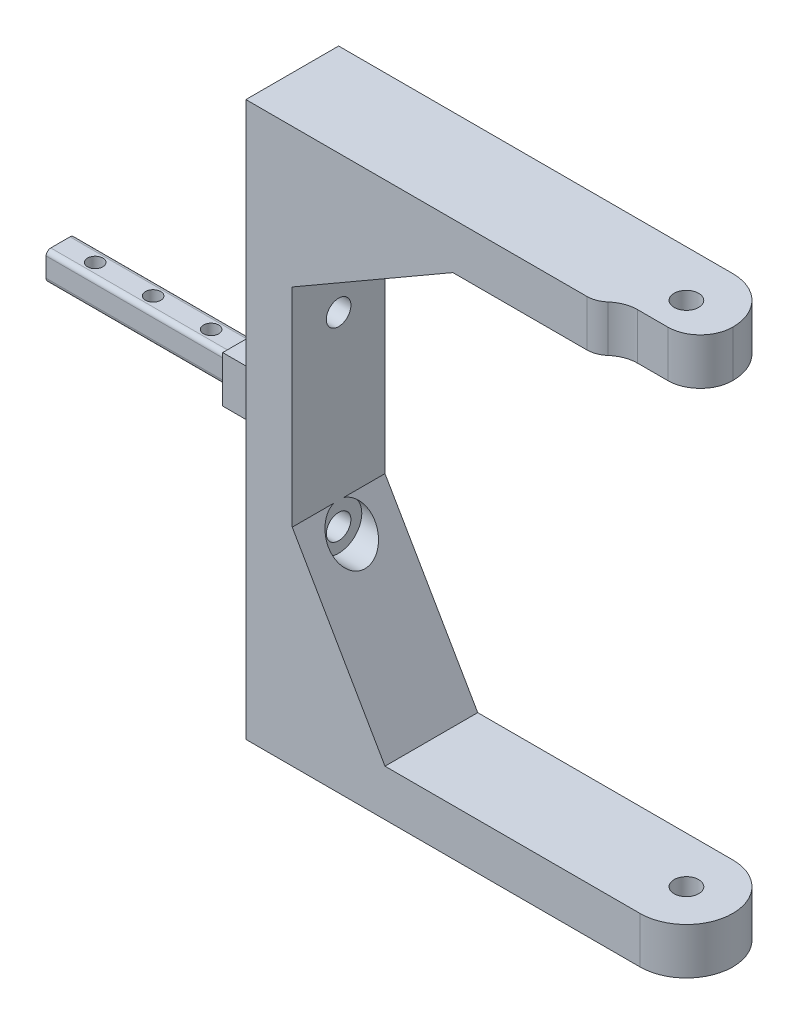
ISO-10303-21;
HEADER;
FILE_DESCRIPTION(('STEP AP214'),'2;1');
FILE_NAME('part.step','',(''),(''),'','','');
FILE_SCHEMA(('AUTOMOTIVE_DESIGN { 1 0 10303 214 1 1 1 1 }'));
ENDSEC;
DATA;
#1=APPLICATION_CONTEXT('core data for automotive mechanical design processes');
#2=APPLICATION_PROTOCOL_DEFINITION('international standard','automotive_design',2000,#1);
#3=PRODUCT_CONTEXT('',#1,'mechanical');
#4=PRODUCT('Part','Part','',(#3));
#5=PRODUCT_RELATED_PRODUCT_CATEGORY('part','',(#4));
#6=PRODUCT_DEFINITION_FORMATION('','',#4);
#7=PRODUCT_DEFINITION_CONTEXT('part definition',#1,'design');
#8=PRODUCT_DEFINITION('design','',#6,#7);
#9=PRODUCT_DEFINITION_SHAPE('','',#8);
#10=(LENGTH_UNIT() NAMED_UNIT(*) SI_UNIT(.MILLI.,.METRE.));
#11=(NAMED_UNIT(*) PLANE_ANGLE_UNIT() SI_UNIT($,.RADIAN.));
#12=(NAMED_UNIT(*) SI_UNIT($,.STERADIAN.) SOLID_ANGLE_UNIT());
#13=UNCERTAINTY_MEASURE_WITH_UNIT(LENGTH_MEASURE(1.E-05),#10,'distance_accuracy_value','');
#14=(GEOMETRIC_REPRESENTATION_CONTEXT(3) GLOBAL_UNCERTAINTY_ASSIGNED_CONTEXT((#13)) GLOBAL_UNIT_ASSIGNED_CONTEXT((#10,
#11,#12)) REPRESENTATION_CONTEXT('',''));
#15=CARTESIAN_POINT('',(0.,0.,0.));
#16=DIRECTION('',(0.,0.,1.));
#17=DIRECTION('',(1.,0.,0.));
#18=AXIS2_PLACEMENT_3D('',#15,#16,#17);
#19=CARTESIAN_POINT('',(85.,59.75,20.));
#20=DIRECTION('',(0.,-1.,0.));
#21=DIRECTION('',(1.,0.,0.));
#22=AXIS2_PLACEMENT_3D('',#19,#20,#21);
#23=PLANE('',#22);
#24=CARTESIAN_POINT('',(74.9999999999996,59.75,10.));
#25=DIRECTION('',(0.,1.,0.));
#26=DIRECTION('',(-1.,0.,0.));
#27=AXIS2_PLACEMENT_3D('',#24,#25,#26);
#28=CIRCLE('',#27,2.65);
#29=CARTESIAN_POINT('',(72.3499999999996,59.75,10.));
#30=VERTEX_POINT('',#29);
#31=EDGE_CURVE('E439',#30,#30,#28,.T.);
#32=ORIENTED_EDGE('',*,*,#31,.F.);
#33=EDGE_LOOP('',(#32));
#34=FACE_BOUND('',#33,.T.);
#35=DIRECTION('',(-1.,0.,0.));
#36=VECTOR('',#35,1.);
#37=CARTESIAN_POINT('',(0.,59.75,17.));
#38=LINE('',#37,#36);
#39=CARTESIAN_POINT('',(77.9999999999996,59.75,17.));
#40=VERTEX_POINT('',#39);
#41=CARTESIAN_POINT('',(71.4726462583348,59.75,17.));
#42=VERTEX_POINT('',#41);
#43=EDGE_CURVE('E937',#40,#42,#38,.T.);
#44=ORIENTED_EDGE('',*,*,#43,.F.);
#45=CARTESIAN_POINT('',(77.9999999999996,59.75,9.99999999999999));
#46=DIRECTION('',(0.,-1.,0.));
#47=DIRECTION('',(1.,0.,0.));
#48=AXIS2_PLACEMENT_3D('',#45,#46,#47);
#49=CIRCLE('',#48,7.);
#50=CARTESIAN_POINT('',(84.9999999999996,59.75,9.99999999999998));
#51=VERTEX_POINT('',#50);
#52=EDGE_CURVE('E310',#40,#51,#49,.F.);
#53=ORIENTED_EDGE('',*,*,#52,.T.);
#54=CARTESIAN_POINT('',(74.9999999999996,59.75,10.));
#55=DIRECTION('',(0.,1.,0.));
#56=DIRECTION('',(-1.,0.,0.));
#57=AXIS2_PLACEMENT_3D('',#54,#55,#56);
#58=CIRCLE('',#57,9.99999999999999);
#59=CARTESIAN_POINT('',(74.9999999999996,59.75,0.));
#60=VERTEX_POINT('',#59);
#61=EDGE_CURVE('E431',#51,#60,#58,.T.);
#62=ORIENTED_EDGE('',*,*,#61,.T.);
#63=DIRECTION('',(-1.,0.,0.));
#64=VECTOR('',#63,1.);
#65=CARTESIAN_POINT('',(85.,59.75,0.));
#66=LINE('',#65,#64);
#67=CARTESIAN_POINT('',(-9.99999999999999,59.75,0.));
#68=VERTEX_POINT('',#67);
#69=EDGE_CURVE('E352',#60,#68,#66,.T.);
#70=ORIENTED_EDGE('',*,*,#69,.T.);
#71=DIRECTION('',(0.,0.,-1.));
#72=VECTOR('',#71,1.);
#73=CARTESIAN_POINT('',(-9.99999999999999,59.75,20.));
#74=LINE('',#73,#72);
#75=CARTESIAN_POINT('',(-9.99999999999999,59.75,20.));
#76=VERTEX_POINT('',#75);
#77=EDGE_CURVE('E330',#76,#68,#74,.T.);
#78=ORIENTED_EDGE('',*,*,#77,.F.);
#79=DIRECTION('',(-1.,0.,0.));
#80=VECTOR('',#79,1.);
#81=CARTESIAN_POINT('',(85.,59.75,20.));
#82=LINE('',#81,#80);
#83=CARTESIAN_POINT('',(63.5353923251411,59.75,20.));
#84=VERTEX_POINT('',#83);
#85=EDGE_CURVE('E321',#84,#76,#82,.T.);
#86=ORIENTED_EDGE('',*,*,#85,.F.);
#87=CARTESIAN_POINT('',(63.5353923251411,59.75,15.));
#88=DIRECTION('',(0.,-1.,0.));
#89=DIRECTION('',(1.,0.,0.));
#90=AXIS2_PLACEMENT_3D('',#87,#88,#89);
#91=CIRCLE('',#90,5.);
#92=CARTESIAN_POINT('',(66.8425814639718,59.75,18.75));
#93=VERTEX_POINT('',#92);
#94=EDGE_CURVE('E308',#84,#93,#91,.F.);
#95=ORIENTED_EDGE('',*,*,#94,.T.);
#96=CARTESIAN_POINT('',(71.4726462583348,59.75,24.));
#97=DIRECTION('',(0.,1.,0.));
#98=DIRECTION('',(-1.,0.,0.));
#99=AXIS2_PLACEMENT_3D('',#96,#97,#98);
#100=CIRCLE('',#99,7.);
#101=EDGE_CURVE('E933',#42,#93,#100,.T.);
#102=ORIENTED_EDGE('',*,*,#101,.F.);
#103=EDGE_LOOP('',(#44,#53,#62,#70,#78,#86,#95,#102));
#104=FACE_BOUND('',#103,.T.);
#105=ADVANCED_FACE('F89',(#34,#104),#23,.F.);
#106=CARTESIAN_POINT('',(-9.99999999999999,-59.75,20.));
#107=DIRECTION('',(0.,1.,0.));
#108=DIRECTION('',(0.,0.,1.));
#109=AXIS2_PLACEMENT_3D('',#106,#107,#108);
#110=PLANE('',#109);
#111=CARTESIAN_POINT('',(74.9999999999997,-59.75,10.));
#112=DIRECTION('',(0.,1.,0.));
#113=DIRECTION('',(-1.,0.,0.));
#114=AXIS2_PLACEMENT_3D('',#111,#112,#113);
#115=CIRCLE('',#114,2.65);
#116=CARTESIAN_POINT('',(72.3499999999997,-59.75,10.));
#117=VERTEX_POINT('',#116);
#118=EDGE_CURVE('E435',#117,#117,#115,.T.);
#119=ORIENTED_EDGE('',*,*,#118,.T.);
#120=EDGE_LOOP('',(#119));
#121=FACE_BOUND('',#120,.T.);
#122=DIRECTION('',(1.,0.,0.));
#123=VECTOR('',#122,1.);
#124=CARTESIAN_POINT('',(-9.99999999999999,-59.75,0.));
#125=LINE('',#124,#123);
#126=CARTESIAN_POINT('',(-9.99999999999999,-59.75,0.));
#127=VERTEX_POINT('',#126);
#128=CARTESIAN_POINT('',(74.9999999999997,-59.75,0.));
#129=VERTEX_POINT('',#128);
#130=EDGE_CURVE('E356',#127,#129,#125,.T.);
#131=ORIENTED_EDGE('',*,*,#130,.T.);
#132=CARTESIAN_POINT('',(74.9999999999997,-59.75,10.));
#133=DIRECTION('',(0.,1.,0.));
#134=DIRECTION('',(-1.,0.,0.));
#135=AXIS2_PLACEMENT_3D('',#132,#133,#134);
#136=CIRCLE('',#135,9.99999999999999);
#137=CARTESIAN_POINT('',(74.9999999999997,-59.75,20.));
#138=VERTEX_POINT('',#137);
#139=EDGE_CURVE('E903',#138,#129,#136,.T.);
#140=ORIENTED_EDGE('',*,*,#139,.F.);
#141=DIRECTION('',(1.,0.,0.));
#142=VECTOR('',#141,1.);
#143=CARTESIAN_POINT('',(-9.99999999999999,-59.75,20.));
#144=LINE('',#143,#142);
#145=CARTESIAN_POINT('',(-9.99999999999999,-59.75,20.));
#146=VERTEX_POINT('',#145);
#147=EDGE_CURVE('E335',#146,#138,#144,.T.);
#148=ORIENTED_EDGE('',*,*,#147,.F.);
#149=DIRECTION('',(0.,0.,-1.));
#150=VECTOR('',#149,1.);
#151=CARTESIAN_POINT('',(-9.99999999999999,-59.75,20.));
#152=LINE('',#151,#150);
#153=EDGE_CURVE('E351',#146,#127,#152,.T.);
#154=ORIENTED_EDGE('',*,*,#153,.T.);
#155=EDGE_LOOP('',(#131,#140,#148,#154));
#156=FACE_BOUND('',#155,.T.);
#157=ADVANCED_FACE('F568',(#121,#156),#110,.F.);
#158=CARTESIAN_POINT('',(85.,-49.75,20.));
#159=DIRECTION('',(0.,-1.,0.));
#160=DIRECTION('',(1.,0.,0.));
#161=AXIS2_PLACEMENT_3D('',#158,#159,#160);
#162=PLANE('',#161);
#163=CARTESIAN_POINT('',(74.9999999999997,-49.75,10.));
#164=DIRECTION('',(0.,-1.,0.));
#165=DIRECTION('',(1.,0.,0.));
#166=AXIS2_PLACEMENT_3D('',#163,#164,#165);
#167=CIRCLE('',#166,2.65);
#168=CARTESIAN_POINT('',(77.6499999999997,-49.75,10.));
#169=VERTEX_POINT('',#168);
#170=EDGE_CURVE('E371',#169,#169,#167,.T.);
#171=ORIENTED_EDGE('',*,*,#170,.T.);
#172=EDGE_LOOP('',(#171));
#173=FACE_BOUND('',#172,.T.);
#174=DIRECTION('',(-1.,0.,0.));
#175=VECTOR('',#174,1.);
#176=CARTESIAN_POINT('',(85.,-49.75,0.));
#177=LINE('',#176,#175);
#178=CARTESIAN_POINT('',(74.9999999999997,-49.75,0.));
#179=VERTEX_POINT('',#178);
#180=CARTESIAN_POINT('',(20.,-49.75,0.));
#181=VERTEX_POINT('',#180);
#182=EDGE_CURVE('E359',#179,#181,#177,.T.);
#183=ORIENTED_EDGE('',*,*,#182,.T.);
#184=DIRECTION('',(0.,0.,1.));
#185=VECTOR('',#184,1.);
#186=CARTESIAN_POINT('',(20.,-49.75,20.));
#187=LINE('',#186,#185);
#188=CARTESIAN_POINT('',(20.,-49.75,20.));
#189=VERTEX_POINT('',#188);
#190=EDGE_CURVE('E287',#181,#189,#187,.T.);
#191=ORIENTED_EDGE('',*,*,#190,.T.);
#192=DIRECTION('',(-1.,0.,0.));
#193=VECTOR('',#192,1.);
#194=CARTESIAN_POINT('',(85.,-49.75,20.));
#195=LINE('',#194,#193);
#196=CARTESIAN_POINT('',(74.9999999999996,-49.75,20.));
#197=VERTEX_POINT('',#196);
#198=EDGE_CURVE('E346',#197,#189,#195,.T.);
#199=ORIENTED_EDGE('',*,*,#198,.F.);
#200=CARTESIAN_POINT('',(74.9999999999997,-49.75,10.));
#201=DIRECTION('',(0.,-1.,0.));
#202=DIRECTION('',(1.,0.,0.));
#203=AXIS2_PLACEMENT_3D('',#200,#201,#202);
#204=CIRCLE('',#203,9.99999999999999);
#205=EDGE_CURVE('E372',#179,#197,#204,.T.);
#206=ORIENTED_EDGE('',*,*,#205,.F.);
#207=EDGE_LOOP('',(#183,#191,#199,#206));
#208=FACE_BOUND('',#207,.T.);
#209=ADVANCED_FACE('F573',(#173,#208),#162,.F.);
#210=CARTESIAN_POINT('',(0.,49.75,20.));
#211=DIRECTION('',(0.,1.,0.));
#212=DIRECTION('',(0.,0.,1.));
#213=AXIS2_PLACEMENT_3D('',#210,#211,#212);
#214=PLANE('',#213);
#215=CARTESIAN_POINT('',(74.9999999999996,49.75,10.));
#216=DIRECTION('',(0.,1.,0.));
#217=DIRECTION('',(0.,0.,1.));
#218=AXIS2_PLACEMENT_3D('',#215,#216,#217);
#219=CIRCLE('',#218,2.65);
#220=CARTESIAN_POINT('',(74.9999999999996,49.75,12.65));
#221=VERTEX_POINT('',#220);
#222=EDGE_CURVE('E368',#221,#221,#219,.T.);
#223=ORIENTED_EDGE('',*,*,#222,.T.);
#224=EDGE_LOOP('',(#223));
#225=FACE_BOUND('',#224,.T.);
#226=CARTESIAN_POINT('',(74.9999999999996,49.75,10.));
#227=DIRECTION('',(0.,1.,0.));
#228=DIRECTION('',(0.,0.,1.));
#229=AXIS2_PLACEMENT_3D('',#226,#227,#228);
#230=CIRCLE('',#229,9.99999999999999);
#231=CARTESIAN_POINT('',(84.9999999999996,49.75,9.99999999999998));
#232=VERTEX_POINT('',#231);
#233=CARTESIAN_POINT('',(74.9999999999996,49.75,0.));
#234=VERTEX_POINT('',#233);
#235=EDGE_CURVE('E433',#232,#234,#230,.T.);
#236=ORIENTED_EDGE('',*,*,#235,.F.);
#237=CARTESIAN_POINT('',(77.9999999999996,49.75,9.99999999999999));
#238=DIRECTION('',(0.,1.,0.));
#239=DIRECTION('',(0.,0.,1.));
#240=AXIS2_PLACEMENT_3D('',#237,#238,#239);
#241=CIRCLE('',#240,7.);
#242=CARTESIAN_POINT('',(77.9999999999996,49.75,17.));
#243=VERTEX_POINT('',#242);
#244=EDGE_CURVE('E315',#232,#243,#241,.F.);
#245=ORIENTED_EDGE('',*,*,#244,.T.);
#246=DIRECTION('',(1.,0.,0.));
#247=VECTOR('',#246,1.);
#248=CARTESIAN_POINT('',(0.,49.75,17.));
#249=LINE('',#248,#247);
#250=CARTESIAN_POINT('',(71.4726462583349,49.75,17.));
#251=VERTEX_POINT('',#250);
#252=EDGE_CURVE('E934',#251,#243,#249,.T.);
#253=ORIENTED_EDGE('',*,*,#252,.F.);
#254=CARTESIAN_POINT('',(71.4726462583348,49.75,24.));
#255=DIRECTION('',(0.,1.,0.));
#256=DIRECTION('',(0.,0.,1.));
#257=AXIS2_PLACEMENT_3D('',#254,#255,#256);
#258=CIRCLE('',#257,7.);
#259=CARTESIAN_POINT('',(66.8425814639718,49.75,18.75));
#260=VERTEX_POINT('',#259);
#261=EDGE_CURVE('E938',#260,#251,#258,.F.);
#262=ORIENTED_EDGE('',*,*,#261,.F.);
#263=CARTESIAN_POINT('',(63.5353923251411,49.75,15.));
#264=DIRECTION('',(0.,1.,0.));
#265=DIRECTION('',(0.,0.,1.));
#266=AXIS2_PLACEMENT_3D('',#263,#264,#265);
#267=CIRCLE('',#266,5.);
#268=CARTESIAN_POINT('',(63.5353923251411,49.75,20.));
#269=VERTEX_POINT('',#268);
#270=EDGE_CURVE('E111',#260,#269,#267,.F.);
#271=ORIENTED_EDGE('',*,*,#270,.T.);
#272=DIRECTION('',(1.,0.,0.));
#273=VECTOR('',#272,1.);
#274=CARTESIAN_POINT('',(0.,49.75,20.));
#275=LINE('',#274,#273);
#276=CARTESIAN_POINT('',(34.6410161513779,49.75,20.));
#277=VERTEX_POINT('',#276);
#278=EDGE_CURVE('E323',#277,#269,#275,.T.);
#279=ORIENTED_EDGE('',*,*,#278,.F.);
#280=DIRECTION('',(0.,0.,-1.));
#281=VECTOR('',#280,1.);
#282=CARTESIAN_POINT('',(34.6410161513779,49.75,0.));
#283=LINE('',#282,#281);
#284=CARTESIAN_POINT('',(34.6410161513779,49.75,0.));
#285=VERTEX_POINT('',#284);
#286=EDGE_CURVE('E289',#277,#285,#283,.T.);
#287=ORIENTED_EDGE('',*,*,#286,.T.);
#288=DIRECTION('',(1.,0.,0.));
#289=VECTOR('',#288,1.);
#290=CARTESIAN_POINT('',(0.,49.75,0.));
#291=LINE('',#290,#289);
#292=EDGE_CURVE('E333',#285,#234,#291,.T.);
#293=ORIENTED_EDGE('',*,*,#292,.T.);
#294=EDGE_LOOP('',(#236,#245,#253,#262,#271,#279,#287,#293));
#295=FACE_BOUND('',#294,.T.);
#296=ADVANCED_FACE('F421',(#225,#295),#214,.F.);
#297=CARTESIAN_POINT('',(0.,0.,0.));
#298=DIRECTION('',(0.,0.,1.));
#299=DIRECTION('',(1.,0.,0.));
#300=AXIS2_PLACEMENT_3D('',#297,#298,#299);
#301=PLANE('',#300);
#302=DIRECTION('',(0.,1.,0.));
#303=VECTOR('',#302,1.);
#304=CARTESIAN_POINT('',(74.9999999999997,-59.75,0.));
#305=LINE('',#304,#303);
#306=EDGE_CURVE('E908',#129,#179,#305,.T.);
#307=ORIENTED_EDGE('',*,*,#306,.F.);
#308=ORIENTED_EDGE('',*,*,#130,.F.);
#309=DIRECTION('',(0.,-1.,0.));
#310=VECTOR('',#309,1.);
#311=CARTESIAN_POINT('',(-9.99999999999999,59.75,0.));
#312=LINE('',#311,#310);
#313=EDGE_CURVE('E354',#68,#127,#312,.T.);
#314=ORIENTED_EDGE('',*,*,#313,.F.);
#315=ORIENTED_EDGE('',*,*,#69,.F.);
#316=DIRECTION('',(0.,1.,0.));
#317=VECTOR('',#316,1.);
#318=CARTESIAN_POINT('',(74.9999999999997,-59.75,0.));
#319=LINE('',#318,#317);
#320=EDGE_CURVE('E367',#234,#60,#319,.T.);
#321=ORIENTED_EDGE('',*,*,#320,.F.);
#322=ORIENTED_EDGE('',*,*,#292,.F.);
#323=DIRECTION('',(0.866025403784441,0.499999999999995,0.));
#324=VECTOR('',#323,1.);
#325=CARTESIAN_POINT('',(-12.8821278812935,22.3125000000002,0.));
#326=LINE('',#325,#324);
#327=CARTESIAN_POINT('',(0.,29.75,0.));
#328=VERTEX_POINT('',#327);
#329=EDGE_CURVE('E301',#285,#328,#326,.F.);
#330=ORIENTED_EDGE('',*,*,#329,.T.);
#331=DIRECTION('',(0.,1.,0.));
#332=VECTOR('',#331,1.);
#333=CARTESIAN_POINT('',(0.,49.75,0.));
#334=LINE('',#333,#332);
#335=CARTESIAN_POINT('',(0.,-15.1089838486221,0.));
#336=VERTEX_POINT('',#335);
#337=EDGE_CURVE('E338',#336,#328,#334,.T.);
#338=ORIENTED_EDGE('',*,*,#337,.F.);
#339=DIRECTION('',(-0.499999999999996,0.866025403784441,0.));
#340=VECTOR('',#339,1.);
#341=CARTESIAN_POINT('',(-6.54238191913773,-3.77724596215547,0.));
#342=LINE('',#341,#340);
#343=EDGE_CURVE('E297',#336,#181,#342,.F.);
#344=ORIENTED_EDGE('',*,*,#343,.T.);
#345=ORIENTED_EDGE('',*,*,#182,.F.);
#346=EDGE_LOOP('',(#307,#308,#314,#315,#321,#322,#330,#338,#344,#345));
#347=FACE_BOUND('',#346,.T.);
#348=ADVANCED_FACE('F425',(#347),#301,.F.);
#349=CARTESIAN_POINT('',(0.,0.,20.));
#350=DIRECTION('',(0.,0.,1.));
#351=DIRECTION('',(1.,0.,0.));
#352=AXIS2_PLACEMENT_3D('',#349,#350,#351);
#353=PLANE('',#352);
#354=ORIENTED_EDGE('',*,*,#278,.T.);
#355=DIRECTION('',(0.,-1.,0.));
#356=VECTOR('',#355,1.);
#357=CARTESIAN_POINT('',(63.5353923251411,59.75,20.));
#358=LINE('',#357,#356);
#359=EDGE_CURVE('E97',#269,#84,#358,.F.);
#360=ORIENTED_EDGE('',*,*,#359,.T.);
#361=ORIENTED_EDGE('',*,*,#85,.T.);
#362=DIRECTION('',(0.,-1.,0.));
#363=VECTOR('',#362,1.);
#364=CARTESIAN_POINT('',(-9.99999999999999,59.75,20.));
#365=LINE('',#364,#363);
#366=EDGE_CURVE('E332',#76,#146,#365,.T.);
#367=ORIENTED_EDGE('',*,*,#366,.T.);
#368=ORIENTED_EDGE('',*,*,#147,.T.);
#369=DIRECTION('',(0.,1.,0.));
#370=VECTOR('',#369,1.);
#371=CARTESIAN_POINT('',(74.9999999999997,-59.75,20.));
#372=LINE('',#371,#370);
#373=EDGE_CURVE('E901',#138,#197,#372,.T.);
#374=ORIENTED_EDGE('',*,*,#373,.T.);
#375=ORIENTED_EDGE('',*,*,#198,.T.);
#376=DIRECTION('',(0.499999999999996,-0.866025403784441,0.));
#377=VECTOR('',#376,1.);
#378=CARTESIAN_POINT('',(0.,-15.1089838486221,20.));
#379=LINE('',#378,#377);
#380=CARTESIAN_POINT('',(0.,-15.1089838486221,20.));
#381=VERTEX_POINT('',#380);
#382=EDGE_CURVE('E299',#189,#381,#379,.F.);
#383=ORIENTED_EDGE('',*,*,#382,.T.);
#384=DIRECTION('',(0.,1.,0.));
#385=VECTOR('',#384,1.);
#386=CARTESIAN_POINT('',(0.,49.75,20.));
#387=LINE('',#386,#385);
#388=CARTESIAN_POINT('',(0.,29.75,20.));
#389=VERTEX_POINT('',#388);
#390=EDGE_CURVE('E286',#381,#389,#387,.T.);
#391=ORIENTED_EDGE('',*,*,#390,.T.);
#392=DIRECTION('',(-0.866025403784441,-0.499999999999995,0.));
#393=VECTOR('',#392,1.);
#394=CARTESIAN_POINT('',(34.6410161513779,49.75,20.));
#395=LINE('',#394,#393);
#396=EDGE_CURVE('E303',#389,#277,#395,.F.);
#397=ORIENTED_EDGE('',*,*,#396,.T.);
#398=EDGE_LOOP('',(#354,#360,#361,#367,#368,#374,#375,#383,#391,#397));
#399=FACE_BOUND('',#398,.T.);
#400=ADVANCED_FACE('F320',(#399),#353,.T.);
#401=CARTESIAN_POINT('',(-20.,0.,0.));
#402=DIRECTION('',(-1.,0.,0.));
#403=DIRECTION('',(0.,-1.,0.));
#404=AXIS2_PLACEMENT_3D('',#401,#402,#403);
#405=PLANE('',#404);
#406=DIRECTION('',(0.,-1.,0.));
#407=VECTOR('',#406,1.);
#408=CARTESIAN_POINT('',(-20.,0.,15.));
#409=LINE('',#408,#407);
#410=CARTESIAN_POINT('',(-20.,5.00000000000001,15.));
#411=VERTEX_POINT('',#410);
#412=CARTESIAN_POINT('',(-20.,-4.99999999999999,15.));
#413=VERTEX_POINT('',#412);
#414=EDGE_CURVE('E468',#411,#413,#409,.T.);
#415=ORIENTED_EDGE('',*,*,#414,.F.);
#416=DIRECTION('',(0.,0.,1.));
#417=VECTOR('',#416,1.);
#418=CARTESIAN_POINT('',(-20.,5.,0.));
#419=LINE('',#418,#417);
#420=CARTESIAN_POINT('',(-20.,5.00000000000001,5.));
#421=VERTEX_POINT('',#420);
#422=EDGE_CURVE('E471',#421,#411,#419,.T.);
#423=ORIENTED_EDGE('',*,*,#422,.F.);
#424=DIRECTION('',(0.,-1.,0.));
#425=VECTOR('',#424,1.);
#426=CARTESIAN_POINT('',(-20.,0.,5.));
#427=LINE('',#426,#425);
#428=CARTESIAN_POINT('',(-20.,-4.99999999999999,5.));
#429=VERTEX_POINT('',#428);
#430=EDGE_CURVE('E475',#421,#429,#427,.T.);
#431=ORIENTED_EDGE('',*,*,#430,.T.);
#432=DIRECTION('',(0.,0.,1.));
#433=VECTOR('',#432,1.);
#434=CARTESIAN_POINT('',(-20.,-4.99999999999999,0.));
#435=LINE('',#434,#433);
#436=EDGE_CURVE('E477',#429,#413,#435,.T.);
#437=ORIENTED_EDGE('',*,*,#436,.T.);
#438=EDGE_LOOP('',(#415,#423,#431,#437));
#439=FACE_BOUND('',#438,.T.);
#440=DIRECTION('',(0.,1.,0.));
#441=VECTOR('',#440,1.);
#442=CARTESIAN_POINT('',(-20.,0.,13.075));
#443=LINE('',#442,#441);
#444=CARTESIAN_POINT('',(-20.,-2.07499999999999,13.075));
#445=VERTEX_POINT('',#444);
#446=CARTESIAN_POINT('',(-20.,2.07500000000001,13.075));
#447=VERTEX_POINT('',#446);
#448=EDGE_CURVE('E450',#445,#447,#443,.T.);
#449=ORIENTED_EDGE('',*,*,#448,.F.);
#450=CARTESIAN_POINT('',(-20.,-2.07499999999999,12.075));
#451=DIRECTION('',(-1.,0.,0.));
#452=DIRECTION('',(0.,-1.,0.));
#453=AXIS2_PLACEMENT_3D('',#450,#451,#452);
#454=CIRCLE('',#453,1.);
#455=CARTESIAN_POINT('',(-20.,-3.07499999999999,12.075));
#456=VERTEX_POINT('',#455);
#457=EDGE_CURVE('E403',#445,#456,#454,.F.);
#458=ORIENTED_EDGE('',*,*,#457,.T.);
#459=DIRECTION('',(0.,0.,-1.));
#460=VECTOR('',#459,1.);
#461=CARTESIAN_POINT('',(-20.,-3.07499999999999,0.));
#462=LINE('',#461,#460);
#463=CARTESIAN_POINT('',(-20.,-3.07499999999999,7.925));
#464=VERTEX_POINT('',#463);
#465=EDGE_CURVE('E445',#456,#464,#462,.T.);
#466=ORIENTED_EDGE('',*,*,#465,.T.);
#467=CARTESIAN_POINT('',(-20.,-2.07499999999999,7.925));
#468=DIRECTION('',(-1.,0.,0.));
#469=DIRECTION('',(0.,-1.,0.));
#470=AXIS2_PLACEMENT_3D('',#467,#468,#469);
#471=CIRCLE('',#470,1.);
#472=CARTESIAN_POINT('',(-20.,-2.07499999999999,6.925));
#473=VERTEX_POINT('',#472);
#474=EDGE_CURVE('E407',#464,#473,#471,.F.);
#475=ORIENTED_EDGE('',*,*,#474,.T.);
#476=DIRECTION('',(0.,1.,0.));
#477=VECTOR('',#476,1.);
#478=CARTESIAN_POINT('',(-20.,0.,6.925));
#479=LINE('',#478,#477);
#480=CARTESIAN_POINT('',(-20.,2.07500000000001,6.925));
#481=VERTEX_POINT('',#480);
#482=EDGE_CURVE('E462',#473,#481,#479,.T.);
#483=ORIENTED_EDGE('',*,*,#482,.T.);
#484=CARTESIAN_POINT('',(-20.,2.07500000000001,7.925));
#485=DIRECTION('',(-1.,0.,0.));
#486=DIRECTION('',(0.,-1.,0.));
#487=AXIS2_PLACEMENT_3D('',#484,#485,#486);
#488=CIRCLE('',#487,1.);
#489=CARTESIAN_POINT('',(-20.,3.07500000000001,7.925));
#490=VERTEX_POINT('',#489);
#491=EDGE_CURVE('E408',#481,#490,#488,.F.);
#492=ORIENTED_EDGE('',*,*,#491,.T.);
#493=DIRECTION('',(0.,0.,-1.));
#494=VECTOR('',#493,1.);
#495=CARTESIAN_POINT('',(-20.,3.07500000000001,0.));
#496=LINE('',#495,#494);
#497=CARTESIAN_POINT('',(-20.,3.07500000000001,12.075));
#498=VERTEX_POINT('',#497);
#499=EDGE_CURVE('E464',#498,#490,#496,.T.);
#500=ORIENTED_EDGE('',*,*,#499,.F.);
#501=CARTESIAN_POINT('',(-20.,2.07500000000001,12.075));
#502=DIRECTION('',(-1.,0.,0.));
#503=DIRECTION('',(0.,-1.,0.));
#504=AXIS2_PLACEMENT_3D('',#501,#502,#503);
#505=CIRCLE('',#504,1.);
#506=EDGE_CURVE('E405',#498,#447,#505,.F.);
#507=ORIENTED_EDGE('',*,*,#506,.T.);
#508=EDGE_LOOP('',(#449,#458,#466,#475,#483,#492,#500,#507));
#509=FACE_BOUND('',#508,.T.);
#510=ADVANCED_FACE('F515',(#439,#509),#405,.T.);
#511=CARTESIAN_POINT('',(-9.99999999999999,59.75,20.));
#512=DIRECTION('',(1.,0.,0.));
#513=DIRECTION('',(0.,1.,0.));
#514=AXIS2_PLACEMENT_3D('',#511,#512,#513);
#515=PLANE('',#514);
#516=CARTESIAN_POINT('',(-9.99999999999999,20.,9.99999999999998));
#517=DIRECTION('',(-1.,0.,0.));
#518=DIRECTION('',(0.,-1.,0.));
#519=AXIS2_PLACEMENT_3D('',#516,#517,#518);
#520=CIRCLE('',#519,2.65);
#521=CARTESIAN_POINT('',(-9.99999999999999,17.35,9.99999999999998));
#522=VERTEX_POINT('',#521);
#523=EDGE_CURVE('E945',#522,#522,#520,.T.);
#524=ORIENTED_EDGE('',*,*,#523,.F.);
#525=EDGE_LOOP('',(#524));
#526=FACE_BOUND('',#525,.T.);
#527=CARTESIAN_POINT('',(-9.99999999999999,-20.,10.));
#528=DIRECTION('',(-1.,0.,0.));
#529=DIRECTION('',(0.,-1.,0.));
#530=AXIS2_PLACEMENT_3D('',#527,#528,#529);
#531=CIRCLE('',#530,2.65);
#532=CARTESIAN_POINT('',(-9.99999999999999,-22.65,10.));
#533=VERTEX_POINT('',#532);
#534=EDGE_CURVE('E271',#533,#533,#531,.T.);
#535=ORIENTED_EDGE('',*,*,#534,.F.);
#536=EDGE_LOOP('',(#535));
#537=FACE_BOUND('',#536,.T.);
#538=DIRECTION('',(0.,0.,1.));
#539=VECTOR('',#538,1.);
#540=CARTESIAN_POINT('',(-9.99999999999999,5.00000000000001,0.));
#541=LINE('',#540,#539);
#542=CARTESIAN_POINT('',(-9.99999999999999,5.,5.));
#543=VERTEX_POINT('',#542);
#544=CARTESIAN_POINT('',(-9.99999999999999,5.,15.));
#545=VERTEX_POINT('',#544);
#546=EDGE_CURVE('E481',#543,#545,#541,.T.);
#547=ORIENTED_EDGE('',*,*,#546,.T.);
#548=DIRECTION('',(0.,-1.,0.));
#549=VECTOR('',#548,1.);
#550=CARTESIAN_POINT('',(-9.99999999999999,0.,15.));
#551=LINE('',#550,#549);
#552=CARTESIAN_POINT('',(-9.99999999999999,-4.99999999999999,15.));
#553=VERTEX_POINT('',#552);
#554=EDGE_CURVE('E459',#545,#553,#551,.T.);
#555=ORIENTED_EDGE('',*,*,#554,.T.);
#556=DIRECTION('',(0.,0.,1.));
#557=VECTOR('',#556,1.);
#558=CARTESIAN_POINT('',(-9.99999999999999,-4.99999999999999,0.));
#559=LINE('',#558,#557);
#560=CARTESIAN_POINT('',(-9.99999999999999,-4.99999999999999,5.));
#561=VERTEX_POINT('',#560);
#562=EDGE_CURVE('E472',#561,#553,#559,.T.);
#563=ORIENTED_EDGE('',*,*,#562,.F.);
#564=DIRECTION('',(0.,-1.,0.));
#565=VECTOR('',#564,1.);
#566=CARTESIAN_POINT('',(-9.99999999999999,0.,5.));
#567=LINE('',#566,#565);
#568=EDGE_CURVE('E483',#543,#561,#567,.T.);
#569=ORIENTED_EDGE('',*,*,#568,.F.);
#570=EDGE_LOOP('',(#547,#555,#563,#569));
#571=FACE_BOUND('',#570,.T.);
#572=ORIENTED_EDGE('',*,*,#313,.T.);
#573=ORIENTED_EDGE('',*,*,#153,.F.);
#574=ORIENTED_EDGE('',*,*,#366,.F.);
#575=ORIENTED_EDGE('',*,*,#77,.T.);
#576=EDGE_LOOP('',(#572,#573,#574,#575));
#577=FACE_BOUND('',#576,.T.);
#578=ADVANCED_FACE('F507',(#526,#537,#571,#577),#515,.F.);
#579=CARTESIAN_POINT('',(0.,49.75,20.));
#580=DIRECTION('',(-1.,0.,0.));
#581=DIRECTION('',(0.,-1.,0.));
#582=AXIS2_PLACEMENT_3D('',#579,#580,#581);
#583=PLANE('',#582);
#584=CARTESIAN_POINT('',(0.,20.,9.99999999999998));
#585=DIRECTION('',(-1.,0.,0.));
#586=DIRECTION('',(0.,-1.,0.));
#587=AXIS2_PLACEMENT_3D('',#584,#585,#586);
#588=CIRCLE('',#587,2.65);
#589=CARTESIAN_POINT('',(0.,17.35,9.99999999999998));
#590=VERTEX_POINT('',#589);
#591=EDGE_CURVE('E942',#590,#590,#588,.F.);
#592=ORIENTED_EDGE('',*,*,#591,.F.);
#593=EDGE_LOOP('',(#592));
#594=FACE_BOUND('',#593,.T.);
#595=ORIENTED_EDGE('',*,*,#390,.F.);
#596=DIRECTION('',(0.,0.,-1.));
#597=VECTOR('',#596,1.);
#598=CARTESIAN_POINT('',(0.,-15.1089838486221,0.));
#599=LINE('',#598,#597);
#600=CARTESIAN_POINT('',(0.,-15.1089838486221,11.0382490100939));
#601=VERTEX_POINT('',#600);
#602=EDGE_CURVE('E278',#381,#601,#599,.T.);
#603=ORIENTED_EDGE('',*,*,#602,.T.);
#604=CARTESIAN_POINT('',(0.,-20.,10.));
#605=DIRECTION('',(-1.,0.,0.));
#606=DIRECTION('',(0.,-1.,0.));
#607=AXIS2_PLACEMENT_3D('',#604,#605,#606);
#608=CIRCLE('',#607,5.);
#609=CARTESIAN_POINT('',(0.,-15.1089838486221,8.96175098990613));
#610=VERTEX_POINT('',#609);
#611=EDGE_CURVE('E266',#610,#601,#608,.T.);
#612=ORIENTED_EDGE('',*,*,#611,.F.);
#613=EDGE_CURVE('E280',#610,#336,#599,.T.);
#614=ORIENTED_EDGE('',*,*,#613,.T.);
#615=ORIENTED_EDGE('',*,*,#337,.T.);
#616=DIRECTION('',(0.,0.,1.));
#617=VECTOR('',#616,1.);
#618=CARTESIAN_POINT('',(0.,29.75,20.));
#619=LINE('',#618,#617);
#620=EDGE_CURVE('E291',#328,#389,#619,.T.);
#621=ORIENTED_EDGE('',*,*,#620,.T.);
#622=EDGE_LOOP('',(#595,#603,#612,#614,#615,#621));
#623=FACE_BOUND('',#622,.T.);
#624=CARTESIAN_POINT('',(0.,-20.,10.));
#625=DIRECTION('',(-1.,0.,0.));
#626=DIRECTION('',(0.,-1.,0.));
#627=AXIS2_PLACEMENT_3D('',#624,#625,#626);
#628=CIRCLE('',#627,2.65);
#629=CARTESIAN_POINT('',(0.,-22.65,10.));
#630=VERTEX_POINT('',#629);
#631=EDGE_CURVE('E272',#630,#630,#628,.T.);
#632=ORIENTED_EDGE('',*,*,#631,.T.);
#633=EDGE_LOOP('',(#632));
#634=FACE_BOUND('',#633,.T.);
#635=ADVANCED_FACE('F283',(#594,#623,#634),#583,.F.);
#636=CARTESIAN_POINT('',(-20.,0.,15.));
#637=DIRECTION('',(0.,0.,1.));
#638=DIRECTION('',(1.,0.,0.));
#639=AXIS2_PLACEMENT_3D('',#636,#637,#638);
#640=PLANE('',#639);
#641=ORIENTED_EDGE('',*,*,#554,.F.);
#642=DIRECTION('',(1.,0.,0.));
#643=VECTOR('',#642,1.);
#644=CARTESIAN_POINT('',(-20.,5.00000000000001,15.));
#645=LINE('',#644,#643);
#646=EDGE_CURVE('E341',#411,#545,#645,.T.);
#647=ORIENTED_EDGE('',*,*,#646,.F.);
#648=ORIENTED_EDGE('',*,*,#414,.T.);
#649=DIRECTION('',(1.,0.,0.));
#650=VECTOR('',#649,1.);
#651=CARTESIAN_POINT('',(-20.,-4.99999999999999,15.));
#652=LINE('',#651,#650);
#653=EDGE_CURVE('E479',#413,#553,#652,.T.);
#654=ORIENTED_EDGE('',*,*,#653,.T.);
#655=EDGE_LOOP('',(#641,#647,#648,#654));
#656=FACE_BOUND('',#655,.T.);
#657=ADVANCED_FACE('F504',(#656),#640,.T.);
#658=CARTESIAN_POINT('',(-20.,5.,0.));
#659=DIRECTION('',(0.,1.,0.));
#660=DIRECTION('',(0.,0.,1.));
#661=AXIS2_PLACEMENT_3D('',#658,#659,#660);
#662=PLANE('',#661);
#663=ORIENTED_EDGE('',*,*,#546,.F.);
#664=DIRECTION('',(1.,0.,0.));
#665=VECTOR('',#664,1.);
#666=CARTESIAN_POINT('',(-20.,5.00000000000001,5.));
#667=LINE('',#666,#665);
#668=EDGE_CURVE('E492',#421,#543,#667,.T.);
#669=ORIENTED_EDGE('',*,*,#668,.F.);
#670=ORIENTED_EDGE('',*,*,#422,.T.);
#671=ORIENTED_EDGE('',*,*,#646,.T.);
#672=EDGE_LOOP('',(#663,#669,#670,#671));
#673=FACE_BOUND('',#672,.T.);
#674=ADVANCED_FACE('F500',(#673),#662,.T.);
#675=CARTESIAN_POINT('',(-20.,0.,5.));
#676=DIRECTION('',(0.,0.,1.));
#677=DIRECTION('',(0.,-1.,0.));
#678=AXIS2_PLACEMENT_3D('',#675,#676,#677);
#679=PLANE('',#678);
#680=ORIENTED_EDGE('',*,*,#568,.T.);
#681=DIRECTION('',(1.,0.,0.));
#682=VECTOR('',#681,1.);
#683=CARTESIAN_POINT('',(-20.,-4.99999999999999,5.));
#684=LINE('',#683,#682);
#685=EDGE_CURVE('E490',#429,#561,#684,.T.);
#686=ORIENTED_EDGE('',*,*,#685,.F.);
#687=ORIENTED_EDGE('',*,*,#430,.F.);
#688=ORIENTED_EDGE('',*,*,#668,.T.);
#689=EDGE_LOOP('',(#680,#686,#687,#688));
#690=FACE_BOUND('',#689,.T.);
#691=ADVANCED_FACE('F510',(#690),#679,.F.);
#692=CARTESIAN_POINT('',(-20.,-4.99999999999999,0.));
#693=DIRECTION('',(0.,1.,0.));
#694=DIRECTION('',(-1.,0.,0.));
#695=AXIS2_PLACEMENT_3D('',#692,#693,#694);
#696=PLANE('',#695);
#697=ORIENTED_EDGE('',*,*,#562,.T.);
#698=ORIENTED_EDGE('',*,*,#653,.F.);
#699=ORIENTED_EDGE('',*,*,#436,.F.);
#700=ORIENTED_EDGE('',*,*,#685,.T.);
#701=EDGE_LOOP('',(#697,#698,#699,#700));
#702=FACE_BOUND('',#701,.T.);
#703=ADVANCED_FACE('F513',(#702),#696,.F.);
#704=CARTESIAN_POINT('',(-60.,-3.075,0.));
#705=DIRECTION('',(0.,-1.,0.));
#706=DIRECTION('',(1.,0.,0.));
#707=AXIS2_PLACEMENT_3D('',#704,#705,#706);
#708=PLANE('',#707);
#709=CARTESIAN_POINT('',(-27.5,-3.07499999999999,10.));
#710=DIRECTION('',(0.,-1.,0.));
#711=DIRECTION('',(1.,0.,0.));
#712=AXIS2_PLACEMENT_3D('',#709,#710,#711);
#713=CIRCLE('',#712,1.65);
#714=CARTESIAN_POINT('',(-25.85,-3.07499999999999,10.));
#715=VERTEX_POINT('',#714);
#716=EDGE_CURVE('E912',#715,#715,#713,.T.);
#717=ORIENTED_EDGE('',*,*,#716,.F.);
#718=EDGE_LOOP('',(#717));
#719=FACE_BOUND('',#718,.T.);
#720=CARTESIAN_POINT('',(-52.5,-3.07499999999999,10.));
#721=DIRECTION('',(0.,-1.,0.));
#722=DIRECTION('',(1.,0.,0.));
#723=AXIS2_PLACEMENT_3D('',#720,#721,#722);
#724=CIRCLE('',#723,1.65);
#725=CARTESIAN_POINT('',(-50.85,-3.07499999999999,10.));
#726=VERTEX_POINT('',#725);
#727=EDGE_CURVE('E915',#726,#726,#724,.T.);
#728=ORIENTED_EDGE('',*,*,#727,.F.);
#729=EDGE_LOOP('',(#728));
#730=FACE_BOUND('',#729,.T.);
#731=CARTESIAN_POINT('',(-40.,-3.07499999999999,10.));
#732=DIRECTION('',(0.,-1.,0.));
#733=DIRECTION('',(1.,0.,0.));
#734=AXIS2_PLACEMENT_3D('',#731,#732,#733);
#735=CIRCLE('',#734,1.65);
#736=CARTESIAN_POINT('',(-38.35,-3.07499999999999,10.));
#737=VERTEX_POINT('',#736);
#738=EDGE_CURVE('E918',#737,#737,#735,.T.);
#739=ORIENTED_EDGE('',*,*,#738,.F.);
#740=EDGE_LOOP('',(#739));
#741=FACE_BOUND('',#740,.T.);
#742=ORIENTED_EDGE('',*,*,#465,.F.);
#743=DIRECTION('',(1.,0.,0.));
#744=VECTOR('',#743,1.);
#745=CARTESIAN_POINT('',(-60.,-3.075,12.075));
#746=LINE('',#745,#744);
#747=CARTESIAN_POINT('',(-60.,-3.075,12.075));
#748=VERTEX_POINT('',#747);
#749=EDGE_CURVE('E383',#456,#748,#746,.F.);
#750=ORIENTED_EDGE('',*,*,#749,.T.);
#751=DIRECTION('',(0.,0.,-1.));
#752=VECTOR('',#751,1.);
#753=CARTESIAN_POINT('',(-60.,-3.075,0.));
#754=LINE('',#753,#752);
#755=CARTESIAN_POINT('',(-60.,-3.075,7.925));
#756=VERTEX_POINT('',#755);
#757=EDGE_CURVE('E446',#748,#756,#754,.T.);
#758=ORIENTED_EDGE('',*,*,#757,.T.);
#759=DIRECTION('',(1.,0.,0.));
#760=VECTOR('',#759,1.);
#761=CARTESIAN_POINT('',(-60.,-3.075,7.925));
#762=LINE('',#761,#760);
#763=EDGE_CURVE('E380',#756,#464,#762,.T.);
#764=ORIENTED_EDGE('',*,*,#763,.T.);
#765=EDGE_LOOP('',(#742,#750,#758,#764));
#766=FACE_BOUND('',#765,.T.);
#767=ADVANCED_FACE('F551',(#719,#730,#741,#766),#708,.T.);
#768=CARTESIAN_POINT('',(-60.,0.,13.075));
#769=DIRECTION('',(0.,0.,-1.));
#770=DIRECTION('',(-1.,0.,0.));
#771=AXIS2_PLACEMENT_3D('',#768,#769,#770);
#772=PLANE('',#771);
#773=DIRECTION('',(0.,1.,0.));
#774=VECTOR('',#773,1.);
#775=CARTESIAN_POINT('',(-60.,0.,13.075));
#776=LINE('',#775,#774);
#777=CARTESIAN_POINT('',(-60.,-2.075,13.075));
#778=VERTEX_POINT('',#777);
#779=CARTESIAN_POINT('',(-60.,2.075,13.075));
#780=VERTEX_POINT('',#779);
#781=EDGE_CURVE('E456',#778,#780,#776,.T.);
#782=ORIENTED_EDGE('',*,*,#781,.F.);
#783=DIRECTION('',(1.,0.,0.));
#784=VECTOR('',#783,1.);
#785=CARTESIAN_POINT('',(-20.,-2.07499999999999,13.075));
#786=LINE('',#785,#784);
#787=EDGE_CURVE('E377',#778,#445,#786,.T.);
#788=ORIENTED_EDGE('',*,*,#787,.T.);
#789=ORIENTED_EDGE('',*,*,#448,.T.);
#790=DIRECTION('',(1.,0.,0.));
#791=VECTOR('',#790,1.);
#792=CARTESIAN_POINT('',(-60.,2.075,13.075));
#793=LINE('',#792,#791);
#794=EDGE_CURVE('E375',#447,#780,#793,.F.);
#795=ORIENTED_EDGE('',*,*,#794,.T.);
#796=EDGE_LOOP('',(#782,#788,#789,#795));
#797=FACE_BOUND('',#796,.T.);
#798=ADVANCED_FACE('F523',(#797),#772,.F.);
#799=CARTESIAN_POINT('',(-60.,3.075,0.));
#800=DIRECTION('',(0.,-1.,0.));
#801=DIRECTION('',(1.,0.,0.));
#802=AXIS2_PLACEMENT_3D('',#799,#800,#801);
#803=PLANE('',#802);
#804=CARTESIAN_POINT('',(-27.5,3.07500000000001,10.));
#805=DIRECTION('',(0.,1.,0.));
#806=DIRECTION('',(-1.,0.,0.));
#807=AXIS2_PLACEMENT_3D('',#804,#805,#806);
#808=CIRCLE('',#807,1.65);
#809=CARTESIAN_POINT('',(-29.15,3.07500000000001,10.));
#810=VERTEX_POINT('',#809);
#811=EDGE_CURVE('E925',#810,#810,#808,.T.);
#812=ORIENTED_EDGE('',*,*,#811,.F.);
#813=EDGE_LOOP('',(#812));
#814=FACE_BOUND('',#813,.T.);
#815=CARTESIAN_POINT('',(-52.5,3.075,10.));
#816=DIRECTION('',(0.,1.,0.));
#817=DIRECTION('',(-1.,0.,0.));
#818=AXIS2_PLACEMENT_3D('',#815,#816,#817);
#819=CIRCLE('',#818,1.65);
#820=CARTESIAN_POINT('',(-54.15,3.075,10.));
#821=VERTEX_POINT('',#820);
#822=EDGE_CURVE('E924',#821,#821,#819,.T.);
#823=ORIENTED_EDGE('',*,*,#822,.F.);
#824=EDGE_LOOP('',(#823));
#825=FACE_BOUND('',#824,.T.);
#826=CARTESIAN_POINT('',(-40.,3.075,10.));
#827=DIRECTION('',(0.,1.,0.));
#828=DIRECTION('',(-1.,0.,0.));
#829=AXIS2_PLACEMENT_3D('',#826,#827,#828);
#830=CIRCLE('',#829,1.65);
#831=CARTESIAN_POINT('',(-41.65,3.075,10.));
#832=VERTEX_POINT('',#831);
#833=EDGE_CURVE('E921',#832,#832,#830,.T.);
#834=ORIENTED_EDGE('',*,*,#833,.F.);
#835=EDGE_LOOP('',(#834));
#836=FACE_BOUND('',#835,.T.);
#837=DIRECTION('',(0.,0.,-1.));
#838=VECTOR('',#837,1.);
#839=CARTESIAN_POINT('',(-60.,3.075,0.));
#840=LINE('',#839,#838);
#841=CARTESIAN_POINT('',(-60.,3.075,12.075));
#842=VERTEX_POINT('',#841);
#843=CARTESIAN_POINT('',(-60.,3.075,7.925));
#844=VERTEX_POINT('',#843);
#845=EDGE_CURVE('E453',#842,#844,#840,.T.);
#846=ORIENTED_EDGE('',*,*,#845,.F.);
#847=DIRECTION('',(1.,0.,0.));
#848=VECTOR('',#847,1.);
#849=CARTESIAN_POINT('',(-60.,3.075,12.075));
#850=LINE('',#849,#848);
#851=EDGE_CURVE('E395',#842,#498,#850,.T.);
#852=ORIENTED_EDGE('',*,*,#851,.T.);
#853=ORIENTED_EDGE('',*,*,#499,.T.);
#854=DIRECTION('',(1.,0.,0.));
#855=VECTOR('',#854,1.);
#856=CARTESIAN_POINT('',(-60.,3.075,7.925));
#857=LINE('',#856,#855);
#858=EDGE_CURVE('E393',#490,#844,#857,.F.);
#859=ORIENTED_EDGE('',*,*,#858,.T.);
#860=EDGE_LOOP('',(#846,#852,#853,#859));
#861=FACE_BOUND('',#860,.T.);
#862=ADVANCED_FACE('F535',(#814,#825,#836,#861),#803,.F.);
#863=CARTESIAN_POINT('',(-60.,0.,6.925));
#864=DIRECTION('',(0.,0.,-1.));
#865=DIRECTION('',(0.,1.,0.));
#866=AXIS2_PLACEMENT_3D('',#863,#864,#865);
#867=PLANE('',#866);
#868=ORIENTED_EDGE('',*,*,#482,.F.);
#869=DIRECTION('',(1.,0.,0.));
#870=VECTOR('',#869,1.);
#871=CARTESIAN_POINT('',(-60.,-2.075,6.925));
#872=LINE('',#871,#870);
#873=CARTESIAN_POINT('',(-60.,-2.075,6.925));
#874=VERTEX_POINT('',#873);
#875=EDGE_CURVE('E401',#473,#874,#872,.F.);
#876=ORIENTED_EDGE('',*,*,#875,.T.);
#877=DIRECTION('',(0.,1.,0.));
#878=VECTOR('',#877,1.);
#879=CARTESIAN_POINT('',(-60.,0.,6.925));
#880=LINE('',#879,#878);
#881=CARTESIAN_POINT('',(-60.,2.075,6.925));
#882=VERTEX_POINT('',#881);
#883=EDGE_CURVE('E449',#874,#882,#880,.T.);
#884=ORIENTED_EDGE('',*,*,#883,.T.);
#885=DIRECTION('',(1.,0.,0.));
#886=VECTOR('',#885,1.);
#887=CARTESIAN_POINT('',(-20.,2.07500000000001,6.925));
#888=LINE('',#887,#886);
#889=EDGE_CURVE('E398',#882,#481,#888,.T.);
#890=ORIENTED_EDGE('',*,*,#889,.T.);
#891=EDGE_LOOP('',(#868,#876,#884,#890));
#892=FACE_BOUND('',#891,.T.);
#893=ADVANCED_FACE('F544',(#892),#867,.T.);
#894=CARTESIAN_POINT('',(-60.,0.,0.));
#895=DIRECTION('',(1.,0.,0.));
#896=DIRECTION('',(0.,1.,0.));
#897=AXIS2_PLACEMENT_3D('',#894,#895,#896);
#898=PLANE('',#897);
#899=ORIENTED_EDGE('',*,*,#757,.F.);
#900=CARTESIAN_POINT('',(-60.,-2.075,12.075));
#901=DIRECTION('',(1.,0.,0.));
#902=DIRECTION('',(0.,1.,0.));
#903=AXIS2_PLACEMENT_3D('',#900,#901,#902);
#904=CIRCLE('',#903,1.);
#905=EDGE_CURVE('E391',#748,#778,#904,.F.);
#906=ORIENTED_EDGE('',*,*,#905,.T.);
#907=ORIENTED_EDGE('',*,*,#781,.T.);
#908=CARTESIAN_POINT('',(-60.,2.075,12.075));
#909=DIRECTION('',(1.,0.,0.));
#910=DIRECTION('',(0.,1.,0.));
#911=AXIS2_PLACEMENT_3D('',#908,#909,#910);
#912=CIRCLE('',#911,1.);
#913=EDGE_CURVE('E389',#780,#842,#912,.F.);
#914=ORIENTED_EDGE('',*,*,#913,.T.);
#915=ORIENTED_EDGE('',*,*,#845,.T.);
#916=CARTESIAN_POINT('',(-60.,2.075,7.925));
#917=DIRECTION('',(1.,0.,0.));
#918=DIRECTION('',(0.,1.,0.));
#919=AXIS2_PLACEMENT_3D('',#916,#917,#918);
#920=CIRCLE('',#919,1.);
#921=EDGE_CURVE('E385',#844,#882,#920,.F.);
#922=ORIENTED_EDGE('',*,*,#921,.T.);
#923=ORIENTED_EDGE('',*,*,#883,.F.);
#924=CARTESIAN_POINT('',(-60.,-2.075,7.925));
#925=DIRECTION('',(1.,0.,0.));
#926=DIRECTION('',(0.,1.,0.));
#927=AXIS2_PLACEMENT_3D('',#924,#925,#926);
#928=CIRCLE('',#927,1.);
#929=EDGE_CURVE('E387',#874,#756,#928,.F.);
#930=ORIENTED_EDGE('',*,*,#929,.T.);
#931=EDGE_LOOP('',(#899,#906,#907,#914,#915,#922,#923,#930));
#932=FACE_BOUND('',#931,.T.);
#933=ADVANCED_FACE('F532',(#932),#898,.F.);
#934=CARTESIAN_POINT('',(74.9999999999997,-59.75,10.));
#935=DIRECTION('',(0.,1.,0.));
#936=DIRECTION('',(-1.,0.,0.));
#937=AXIS2_PLACEMENT_3D('',#934,#935,#936);
#938=CYLINDRICAL_SURFACE('',#937,9.99999999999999);
#939=ORIENTED_EDGE('',*,*,#61,.F.);
#940=DIRECTION('',(0.,1.,0.));
#941=VECTOR('',#940,1.);
#942=CARTESIAN_POINT('',(84.9999999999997,-59.75,9.99999999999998));
#943=LINE('',#942,#941);
#944=EDGE_CURVE('E312',#51,#232,#943,.F.);
#945=ORIENTED_EDGE('',*,*,#944,.T.);
#946=ORIENTED_EDGE('',*,*,#235,.T.);
#947=ORIENTED_EDGE('',*,*,#320,.T.);
#948=EDGE_LOOP('',(#939,#945,#946,#947));
#949=FACE_BOUND('',#948,.T.);
#950=ADVANCED_FACE('F430',(#949),#938,.T.);
#951=ORIENTED_EDGE('',*,*,#205,.T.);
#952=ORIENTED_EDGE('',*,*,#373,.F.);
#953=ORIENTED_EDGE('',*,*,#139,.T.);
#954=ORIENTED_EDGE('',*,*,#306,.T.);
#955=EDGE_LOOP('',(#951,#952,#953,#954));
#956=FACE_BOUND('',#955,.T.);
#957=ADVANCED_FACE('F614',(#956),#938,.T.);
#958=CARTESIAN_POINT('',(74.9999999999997,-59.75,10.));
#959=DIRECTION('',(0.,1.,0.));
#960=DIRECTION('',(-1.,0.,0.));
#961=AXIS2_PLACEMENT_3D('',#958,#959,#960);
#962=CYLINDRICAL_SURFACE('',#961,2.65);
#963=ORIENTED_EDGE('',*,*,#31,.T.);
#964=EDGE_LOOP('',(#963));
#965=FACE_BOUND('',#964,.T.);
#966=ORIENTED_EDGE('',*,*,#222,.F.);
#967=EDGE_LOOP('',(#966));
#968=FACE_BOUND('',#967,.T.);
#969=ADVANCED_FACE('F563',(#965,#968),#962,.F.);
#970=ORIENTED_EDGE('',*,*,#118,.F.);
#971=EDGE_LOOP('',(#970));
#972=FACE_BOUND('',#971,.T.);
#973=ORIENTED_EDGE('',*,*,#170,.F.);
#974=EDGE_LOOP('',(#973));
#975=FACE_BOUND('',#974,.T.);
#976=ADVANCED_FACE('F556',(#972,#975),#962,.F.);
#977=CARTESIAN_POINT('',(-60.,-2.075,12.075));
#978=DIRECTION('',(-1.,0.,0.));
#979=DIRECTION('',(0.,-1.,0.));
#980=AXIS2_PLACEMENT_3D('',#977,#978,#979);
#981=CYLINDRICAL_SURFACE('',#980,1.);
#982=ORIENTED_EDGE('',*,*,#905,.F.);
#983=ORIENTED_EDGE('',*,*,#749,.F.);
#984=ORIENTED_EDGE('',*,*,#457,.F.);
#985=ORIENTED_EDGE('',*,*,#787,.F.);
#986=EDGE_LOOP('',(#982,#983,#984,#985));
#987=FACE_BOUND('',#986,.T.);
#988=ADVANCED_FACE('F554',(#987),#981,.T.);
#989=CARTESIAN_POINT('',(-60.,2.075,12.075));
#990=DIRECTION('',(1.,0.,0.));
#991=DIRECTION('',(0.,1.,0.));
#992=AXIS2_PLACEMENT_3D('',#989,#990,#991);
#993=CYLINDRICAL_SURFACE('',#992,1.);
#994=ORIENTED_EDGE('',*,*,#913,.F.);
#995=ORIENTED_EDGE('',*,*,#794,.F.);
#996=ORIENTED_EDGE('',*,*,#506,.F.);
#997=ORIENTED_EDGE('',*,*,#851,.F.);
#998=EDGE_LOOP('',(#994,#995,#996,#997));
#999=FACE_BOUND('',#998,.T.);
#1000=ADVANCED_FACE('F527',(#999),#993,.T.);
#1001=CARTESIAN_POINT('',(-60.,-2.075,7.925));
#1002=DIRECTION('',(1.,0.,0.));
#1003=DIRECTION('',(0.,1.,0.));
#1004=AXIS2_PLACEMENT_3D('',#1001,#1002,#1003);
#1005=CYLINDRICAL_SURFACE('',#1004,1.);
#1006=ORIENTED_EDGE('',*,*,#929,.F.);
#1007=ORIENTED_EDGE('',*,*,#875,.F.);
#1008=ORIENTED_EDGE('',*,*,#474,.F.);
#1009=ORIENTED_EDGE('',*,*,#763,.F.);
#1010=EDGE_LOOP('',(#1006,#1007,#1008,#1009));
#1011=FACE_BOUND('',#1010,.T.);
#1012=ADVANCED_FACE('F547',(#1011),#1005,.T.);
#1013=CARTESIAN_POINT('',(-60.,2.075,7.925));
#1014=DIRECTION('',(-1.,0.,0.));
#1015=DIRECTION('',(0.,-1.,0.));
#1016=AXIS2_PLACEMENT_3D('',#1013,#1014,#1015);
#1017=CYLINDRICAL_SURFACE('',#1016,1.);
#1018=ORIENTED_EDGE('',*,*,#921,.F.);
#1019=ORIENTED_EDGE('',*,*,#858,.F.);
#1020=ORIENTED_EDGE('',*,*,#491,.F.);
#1021=ORIENTED_EDGE('',*,*,#889,.F.);
#1022=EDGE_LOOP('',(#1018,#1019,#1020,#1021));
#1023=FACE_BOUND('',#1022,.T.);
#1024=ADVANCED_FACE('F538',(#1023),#1017,.T.);
#1025=CARTESIAN_POINT('',(-40.,-59.75,10.));
#1026=DIRECTION('',(0.,1.,0.));
#1027=DIRECTION('',(-1.,0.,0.));
#1028=AXIS2_PLACEMENT_3D('',#1025,#1026,#1027);
#1029=CYLINDRICAL_SURFACE('',#1028,1.65);
#1030=ORIENTED_EDGE('',*,*,#738,.T.);
#1031=EDGE_LOOP('',(#1030));
#1032=FACE_BOUND('',#1031,.T.);
#1033=ORIENTED_EDGE('',*,*,#833,.T.);
#1034=EDGE_LOOP('',(#1033));
#1035=FACE_BOUND('',#1034,.T.);
#1036=ADVANCED_FACE('F618',(#1032,#1035),#1029,.F.);
#1037=CARTESIAN_POINT('',(-52.5,-59.75,10.));
#1038=DIRECTION('',(0.,1.,0.));
#1039=DIRECTION('',(-1.,0.,0.));
#1040=AXIS2_PLACEMENT_3D('',#1037,#1038,#1039);
#1041=CYLINDRICAL_SURFACE('',#1040,1.65);
#1042=ORIENTED_EDGE('',*,*,#727,.T.);
#1043=EDGE_LOOP('',(#1042));
#1044=FACE_BOUND('',#1043,.T.);
#1045=ORIENTED_EDGE('',*,*,#822,.T.);
#1046=EDGE_LOOP('',(#1045));
#1047=FACE_BOUND('',#1046,.T.);
#1048=ADVANCED_FACE('F621',(#1044,#1047),#1041,.F.);
#1049=CARTESIAN_POINT('',(-27.5,-59.7499999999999,10.));
#1050=DIRECTION('',(0.,1.,0.));
#1051=DIRECTION('',(-1.,0.,0.));
#1052=AXIS2_PLACEMENT_3D('',#1049,#1050,#1051);
#1053=CYLINDRICAL_SURFACE('',#1052,1.65);
#1054=ORIENTED_EDGE('',*,*,#716,.T.);
#1055=EDGE_LOOP('',(#1054));
#1056=FACE_BOUND('',#1055,.T.);
#1057=ORIENTED_EDGE('',*,*,#811,.T.);
#1058=EDGE_LOOP('',(#1057));
#1059=FACE_BOUND('',#1058,.T.);
#1060=ADVANCED_FACE('F623',(#1056,#1059),#1053,.F.);
#1061=CARTESIAN_POINT('',(0.,-15.1089838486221,20.));
#1062=DIRECTION('',(0.866025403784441,0.499999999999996,0.));
#1063=DIRECTION('',(0.,0.,1.));
#1064=AXIS2_PLACEMENT_3D('',#1061,#1062,#1063);
#1065=PLANE('',#1064);
#1066=ORIENTED_EDGE('',*,*,#613,.F.);
#1067=CARTESIAN_POINT('',(2.8238294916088,-20.,10.));
#1068=DIRECTION('',(0.866025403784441,0.499999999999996,0.));
#1069=DIRECTION('',(-0.499999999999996,0.866025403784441,0.));
#1070=AXIS2_PLACEMENT_3D('',#1067,#1068,#1069);
#1071=ELLIPSE('',#1070,5.77350269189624,5.);
#1072=EDGE_CURVE('E103',#601,#610,#1071,.T.);
#1073=ORIENTED_EDGE('',*,*,#1072,.F.);
#1074=ORIENTED_EDGE('',*,*,#602,.F.);
#1075=ORIENTED_EDGE('',*,*,#382,.F.);
#1076=ORIENTED_EDGE('',*,*,#190,.F.);
#1077=ORIENTED_EDGE('',*,*,#343,.F.);
#1078=EDGE_LOOP('',(#1066,#1073,#1074,#1075,#1076,#1077));
#1079=FACE_BOUND('',#1078,.T.);
#1080=ADVANCED_FACE('F276',(#1079),#1065,.T.);
#1081=CARTESIAN_POINT('',(34.6410161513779,49.75,20.));
#1082=DIRECTION('',(0.499999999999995,-0.866025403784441,0.));
#1083=DIRECTION('',(0.,0.,1.));
#1084=AXIS2_PLACEMENT_3D('',#1081,#1082,#1083);
#1085=PLANE('',#1084);
#1086=ORIENTED_EDGE('',*,*,#396,.F.);
#1087=ORIENTED_EDGE('',*,*,#620,.F.);
#1088=ORIENTED_EDGE('',*,*,#329,.F.);
#1089=ORIENTED_EDGE('',*,*,#286,.F.);
#1090=EDGE_LOOP('',(#1086,#1087,#1088,#1089));
#1091=FACE_BOUND('',#1090,.T.);
#1092=ADVANCED_FACE('F418',(#1091),#1085,.T.);
#1093=CARTESIAN_POINT('',(71.4726462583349,-59.7509999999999,24.));
#1094=DIRECTION('',(0.,1.,0.));
#1095=DIRECTION('',(-1.,0.,0.));
#1096=AXIS2_PLACEMENT_3D('',#1093,#1094,#1095);
#1097=CYLINDRICAL_SURFACE('',#1096,7.);
#1098=ORIENTED_EDGE('',*,*,#101,.T.);
#1099=DIRECTION('',(0.,1.,0.));
#1100=VECTOR('',#1099,1.);
#1101=CARTESIAN_POINT('',(66.8425814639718,-59.7509999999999,18.75));
#1102=LINE('',#1101,#1100);
#1103=EDGE_CURVE('E13',#93,#260,#1102,.F.);
#1104=ORIENTED_EDGE('',*,*,#1103,.T.);
#1105=ORIENTED_EDGE('',*,*,#261,.T.);
#1106=DIRECTION('',(0.,1.,0.));
#1107=VECTOR('',#1106,1.);
#1108=CARTESIAN_POINT('',(71.4726462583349,-59.7509999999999,17.));
#1109=LINE('',#1108,#1107);
#1110=EDGE_CURVE('E928',#251,#42,#1109,.T.);
#1111=ORIENTED_EDGE('',*,*,#1110,.T.);
#1112=EDGE_LOOP('',(#1098,#1104,#1105,#1111));
#1113=FACE_BOUND('',#1112,.T.);
#1114=ADVANCED_FACE('F630',(#1113),#1097,.F.);
#1115=CARTESIAN_POINT('',(0.,-59.751,17.));
#1116=DIRECTION('',(0.,0.,-1.));
#1117=DIRECTION('',(-1.,0.,0.));
#1118=AXIS2_PLACEMENT_3D('',#1115,#1116,#1117);
#1119=PLANE('',#1118);
#1120=ORIENTED_EDGE('',*,*,#252,.T.);
#1121=DIRECTION('',(0.,-1.,0.));
#1122=VECTOR('',#1121,1.);
#1123=CARTESIAN_POINT('',(77.9999999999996,59.75,17.));
#1124=LINE('',#1123,#1122);
#1125=EDGE_CURVE('E305',#243,#40,#1124,.F.);
#1126=ORIENTED_EDGE('',*,*,#1125,.T.);
#1127=ORIENTED_EDGE('',*,*,#43,.T.);
#1128=ORIENTED_EDGE('',*,*,#1110,.F.);
#1129=EDGE_LOOP('',(#1120,#1126,#1127,#1128));
#1130=FACE_BOUND('',#1129,.T.);
#1131=ADVANCED_FACE('F633',(#1130),#1119,.F.);
#1132=CARTESIAN_POINT('',(77.9999999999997,-59.75,9.99999999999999));
#1133=DIRECTION('',(0.,1.,0.));
#1134=DIRECTION('',(-1.,0.,0.));
#1135=AXIS2_PLACEMENT_3D('',#1132,#1133,#1134);
#1136=CYLINDRICAL_SURFACE('',#1135,7.);
#1137=ORIENTED_EDGE('',*,*,#244,.F.);
#1138=ORIENTED_EDGE('',*,*,#944,.F.);
#1139=ORIENTED_EDGE('',*,*,#52,.F.);
#1140=ORIENTED_EDGE('',*,*,#1125,.F.);
#1141=EDGE_LOOP('',(#1137,#1138,#1139,#1140));
#1142=FACE_BOUND('',#1141,.T.);
#1143=ADVANCED_FACE('F637',(#1142),#1136,.T.);
#1144=CARTESIAN_POINT('',(63.5353923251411,-59.7509999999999,15.));
#1145=DIRECTION('',(0.,1.,0.));
#1146=DIRECTION('',(-1.,0.,0.));
#1147=AXIS2_PLACEMENT_3D('',#1144,#1145,#1146);
#1148=CYLINDRICAL_SURFACE('',#1147,5.);
#1149=ORIENTED_EDGE('',*,*,#270,.F.);
#1150=ORIENTED_EDGE('',*,*,#1103,.F.);
#1151=ORIENTED_EDGE('',*,*,#94,.F.);
#1152=ORIENTED_EDGE('',*,*,#359,.F.);
#1153=EDGE_LOOP('',(#1149,#1150,#1151,#1152));
#1154=FACE_BOUND('',#1153,.T.);
#1155=ADVANCED_FACE('F91',(#1154),#1148,.T.);
#1156=CARTESIAN_POINT('',(85.001,-20.,10.));
#1157=DIRECTION('',(-1.,0.,0.));
#1158=DIRECTION('',(0.,-1.,0.));
#1159=AXIS2_PLACEMENT_3D('',#1156,#1157,#1158);
#1160=CYLINDRICAL_SURFACE('',#1159,2.65);
#1161=ORIENTED_EDGE('',*,*,#631,.F.);
#1162=EDGE_LOOP('',(#1161));
#1163=FACE_BOUND('',#1162,.T.);
#1164=ORIENTED_EDGE('',*,*,#534,.T.);
#1165=EDGE_LOOP('',(#1164));
#1166=FACE_BOUND('',#1165,.T.);
#1167=ADVANCED_FACE('F639',(#1163,#1166),#1160,.F.);
#1168=CARTESIAN_POINT('',(85.001,20.,9.99999999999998));
#1169=DIRECTION('',(-1.,0.,0.));
#1170=DIRECTION('',(0.,-1.,0.));
#1171=AXIS2_PLACEMENT_3D('',#1168,#1169,#1170);
#1172=CYLINDRICAL_SURFACE('',#1171,2.65);
#1173=ORIENTED_EDGE('',*,*,#523,.T.);
#1174=EDGE_LOOP('',(#1173));
#1175=FACE_BOUND('',#1174,.T.);
#1176=ORIENTED_EDGE('',*,*,#591,.T.);
#1177=EDGE_LOOP('',(#1176));
#1178=FACE_BOUND('',#1177,.T.);
#1179=ADVANCED_FACE('F642',(#1175,#1178),#1172,.F.);
#1180=CARTESIAN_POINT('',(85.001,-20.,10.));
#1181=DIRECTION('',(-1.,0.,0.));
#1182=DIRECTION('',(0.,-1.,0.));
#1183=AXIS2_PLACEMENT_3D('',#1180,#1181,#1182);
#1184=CYLINDRICAL_SURFACE('',#1183,5.);
#1185=ORIENTED_EDGE('',*,*,#1072,.T.);
#1186=ORIENTED_EDGE('',*,*,#611,.T.);
#1187=EDGE_LOOP('',(#1185,#1186));
#1188=FACE_BOUND('',#1187,.T.);
#1189=ADVANCED_FACE('F267',(#1188),#1184,.F.);
#1190=CLOSED_SHELL('',(#105,#157,#209,#296,#348,#400,#510,#578,#635,#657,#674,#691,#703,#767,
#798,#862,#893,#933,#950,#957,#969,#976,#988,#1000,#1012,#1024,#1036,#1048,#1060,#1080,#1092,
#1114,#1131,#1143,#1155,#1167,#1179,#1189));
#1191=MANIFOLD_SOLID_BREP('B2',#1190);
#1192=ADVANCED_BREP_SHAPE_REPRESENTATION('',(#18,#1191),#14);
#1193=SHAPE_DEFINITION_REPRESENTATION(#9,#1192);
ENDSEC;
END-ISO-10303-21;
